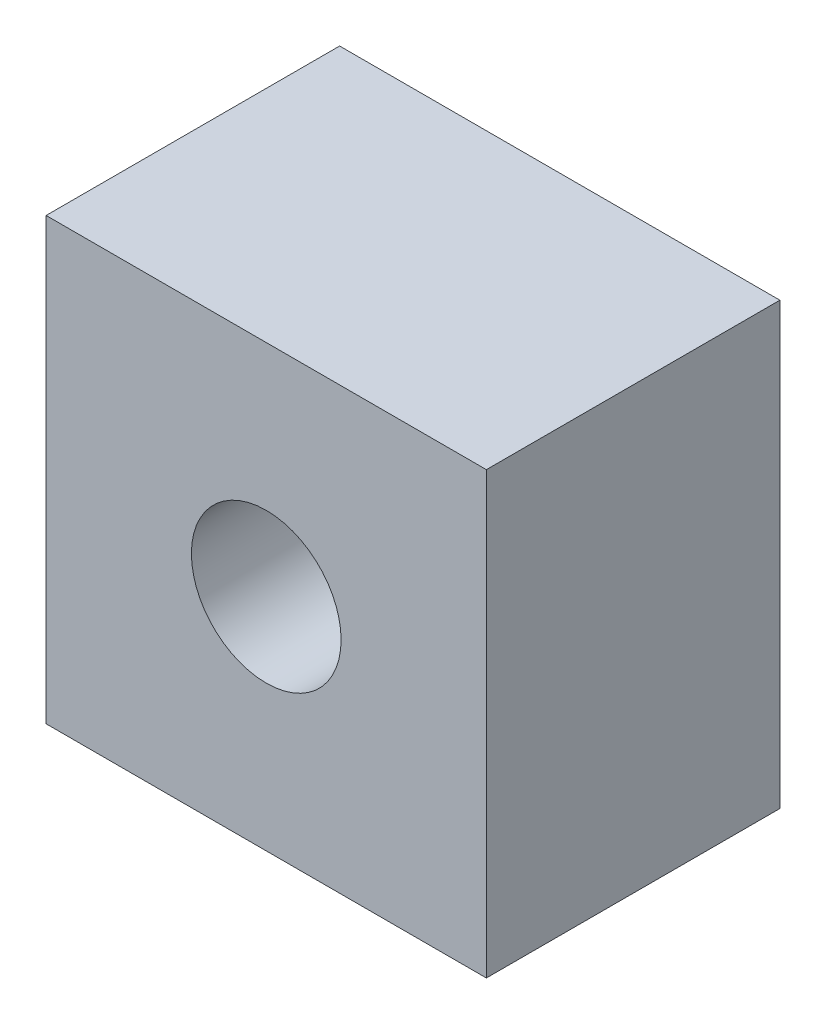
from build123d import *

# Parameters (mm, degrees)
ESQUISSE1_W        = 30
ESQUISSE1_H        = 30
EXTRUSION1_DEPTH   = 20
TROU_TARAUD_M121_D = 10.2


with BuildPart() as part:
    # Esquisse1 → Extrusion1 (new body)
    with BuildSketch(Plane.XY):
        Rectangle(ESQUISSE1_W, ESQUISSE1_H)
    extrude(amount=EXTRUSION1_DEPTH)

    # Trou taraud_ M121 (through all)
    with Locations(Plane.XY.offset(20)):
        with Locations((0, 0)):
            Hole(TROU_TARAUD_M121_D / 2)


solid = part.part
